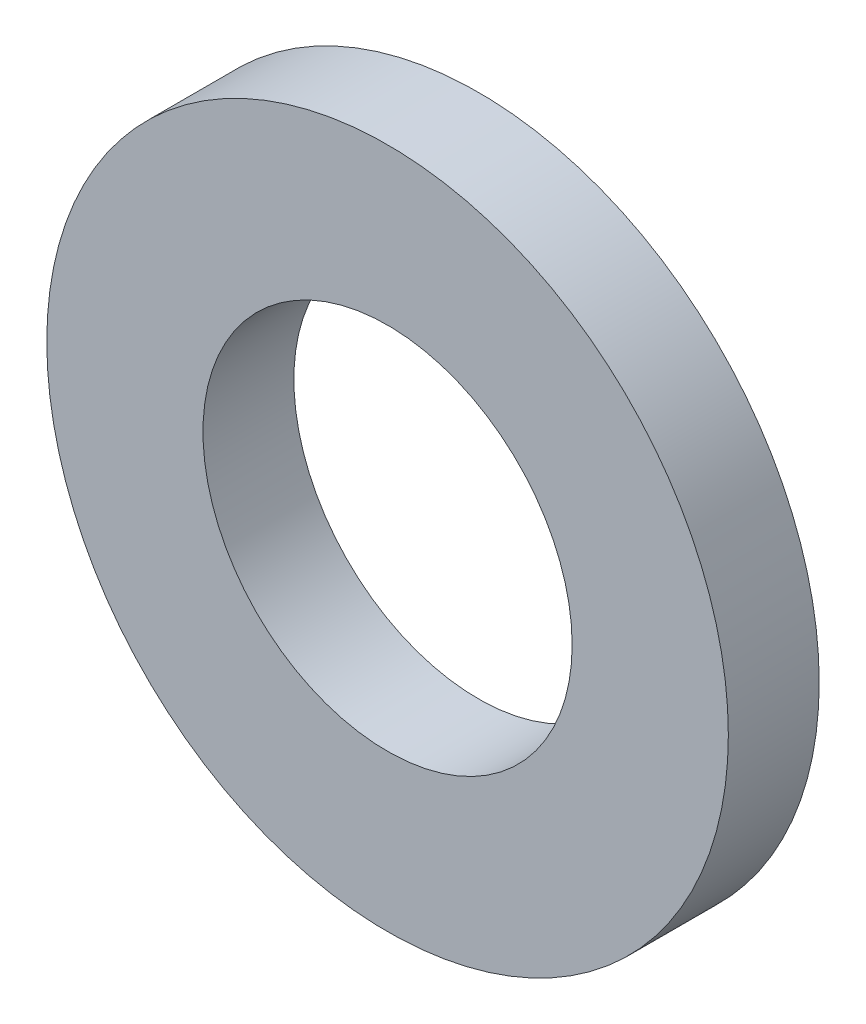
from build123d import *

# Parameters (mm, degrees)
ESQUISSE1_R      = 6
ESQUISSE1_R_2    = 3.25
EXTRUSION1_DEPTH = 1.6


with BuildPart() as part:
    # Esquisse1 → Extrusion1 (new body)
    with BuildSketch(Plane.XY):
        Circle(ESQUISSE1_R)
        Circle(ESQUISSE1_R_2, mode=Mode.SUBTRACT)
    extrude(amount=EXTRUSION1_DEPTH)


solid = part.part
